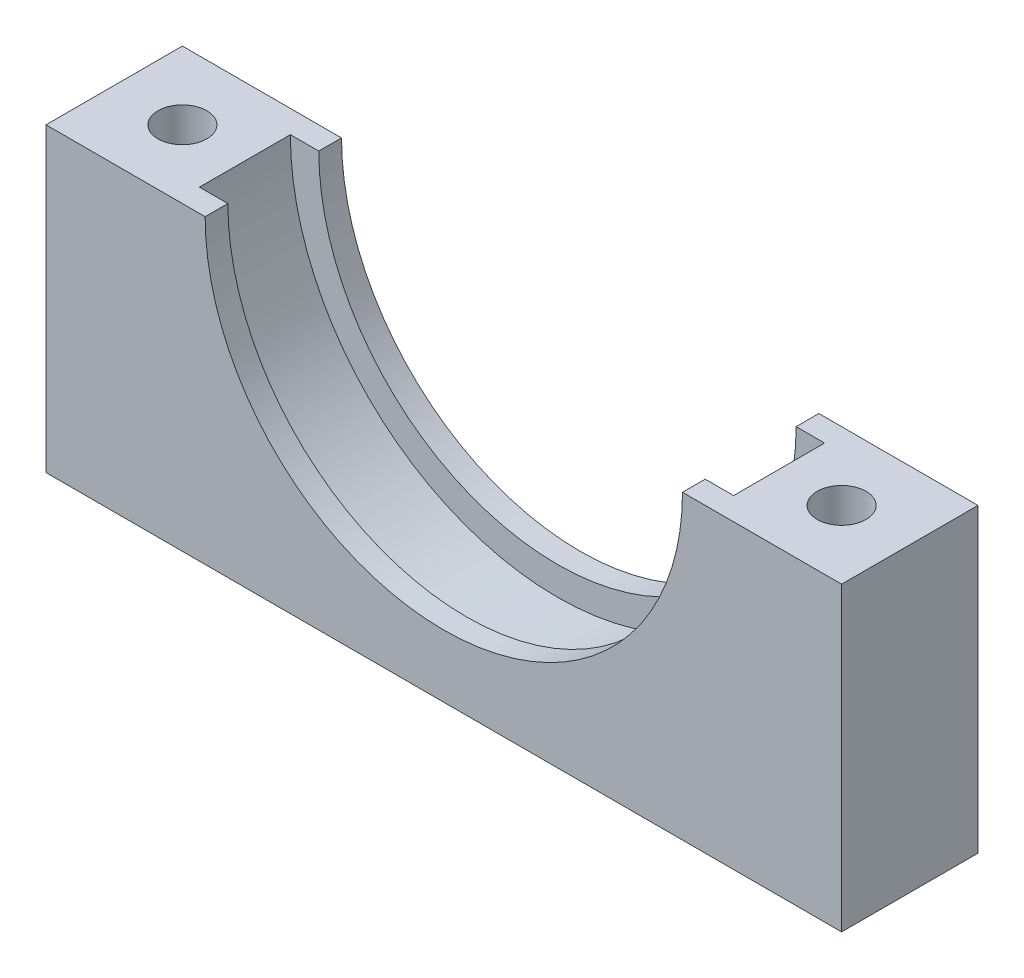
ISO-10303-21;
HEADER;
FILE_DESCRIPTION(('STEP AP214'),'2;1');
FILE_NAME('part.step','',(''),(''),'','','');
FILE_SCHEMA(('AUTOMOTIVE_DESIGN { 1 0 10303 214 1 1 1 1 }'));
ENDSEC;
DATA;
#1=APPLICATION_CONTEXT('core data for automotive mechanical design processes');
#2=APPLICATION_PROTOCOL_DEFINITION('international standard','automotive_design',2000,#1);
#3=PRODUCT_CONTEXT('',#1,'mechanical');
#4=PRODUCT('Part','Part','',(#3));
#5=PRODUCT_RELATED_PRODUCT_CATEGORY('part','',(#4));
#6=PRODUCT_DEFINITION_FORMATION('','',#4);
#7=PRODUCT_DEFINITION_CONTEXT('part definition',#1,'design');
#8=PRODUCT_DEFINITION('design','',#6,#7);
#9=PRODUCT_DEFINITION_SHAPE('','',#8);
#10=(LENGTH_UNIT() NAMED_UNIT(*) SI_UNIT(.MILLI.,.METRE.));
#11=(NAMED_UNIT(*) PLANE_ANGLE_UNIT() SI_UNIT($,.RADIAN.));
#12=(NAMED_UNIT(*) SI_UNIT($,.STERADIAN.) SOLID_ANGLE_UNIT());
#13=UNCERTAINTY_MEASURE_WITH_UNIT(LENGTH_MEASURE(1.E-05),#10,'distance_accuracy_value','');
#14=(GEOMETRIC_REPRESENTATION_CONTEXT(3) GLOBAL_UNCERTAINTY_ASSIGNED_CONTEXT((#13)) GLOBAL_UNIT_ASSIGNED_CONTEXT((#10,
#11,#12)) REPRESENTATION_CONTEXT('',''));
#15=CARTESIAN_POINT('',(0.,0.,0.));
#16=DIRECTION('',(0.,0.,1.));
#17=DIRECTION('',(1.,0.,0.));
#18=AXIS2_PLACEMENT_3D('',#15,#16,#17);
#19=CARTESIAN_POINT('',(53.,-25.,-86.8481796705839));
#20=DIRECTION('',(0.,1.,0.));
#21=DIRECTION('',(0.,0.,1.));
#22=AXIS2_PLACEMENT_3D('',#19,#20,#21);
#23=PLANE('',#22);
#24=CARTESIAN_POINT('',(45.,-25.,-6.));
#25=DIRECTION('',(0.,1.,0.));
#26=DIRECTION('',(0.,0.,1.));
#27=AXIS2_PLACEMENT_3D('',#24,#25,#26);
#28=CIRCLE('',#27,2.15);
#29=CARTESIAN_POINT('',(45.,-25.,-3.85));
#30=VERTEX_POINT('',#29);
#31=EDGE_CURVE('E159',#30,#30,#28,.T.);
#32=ORIENTED_EDGE('',*,*,#31,.F.);
#33=EDGE_LOOP('',(#32));
#34=FACE_BOUND('',#33,.T.);
#35=DIRECTION('',(0.,0.,-1.));
#36=VECTOR('',#35,1.);
#37=CARTESIAN_POINT('',(50.5,-25.,-2.));
#38=LINE('',#37,#36);
#39=CARTESIAN_POINT('',(50.5,-25.,-2.));
#40=VERTEX_POINT('',#39);
#41=CARTESIAN_POINT('',(50.5,-25.,-10.));
#42=VERTEX_POINT('',#41);
#43=EDGE_CURVE('E193',#40,#42,#38,.T.);
#44=ORIENTED_EDGE('',*,*,#43,.T.);
#45=DIRECTION('',(1.,0.,0.));
#46=VECTOR('',#45,1.);
#47=CARTESIAN_POINT('',(50.5,-25.,-10.));
#48=LINE('',#47,#46);
#49=CARTESIAN_POINT('',(53.,-25.,-10.));
#50=VERTEX_POINT('',#49);
#51=EDGE_CURVE('E166',#42,#50,#48,.T.);
#52=ORIENTED_EDGE('',*,*,#51,.T.);
#53=DIRECTION('',(0.,0.,1.));
#54=VECTOR('',#53,1.);
#55=CARTESIAN_POINT('',(53.,-25.,-86.8481796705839));
#56=LINE('',#55,#54);
#57=CARTESIAN_POINT('',(53.,-25.,-12.));
#58=VERTEX_POINT('',#57);
#59=EDGE_CURVE('E156',#58,#50,#56,.T.);
#60=ORIENTED_EDGE('',*,*,#59,.F.);
#61=DIRECTION('',(-1.,0.,0.));
#62=VECTOR('',#61,1.);
#63=CARTESIAN_POINT('',(53.,-25.,-12.));
#64=LINE('',#63,#62);
#65=CARTESIAN_POINT('',(39.,-25.,-12.));
#66=VERTEX_POINT('',#65);
#67=EDGE_CURVE('E86',#58,#66,#64,.T.);
#68=ORIENTED_EDGE('',*,*,#67,.T.);
#69=DIRECTION('',(0.,0.,1.));
#70=VECTOR('',#69,1.);
#71=CARTESIAN_POINT('',(39.,-25.,-86.8481796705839));
#72=LINE('',#71,#70);
#73=CARTESIAN_POINT('',(39.,-25.,0.));
#74=VERTEX_POINT('',#73);
#75=EDGE_CURVE('E136',#66,#74,#72,.T.);
#76=ORIENTED_EDGE('',*,*,#75,.T.);
#77=DIRECTION('',(-1.,0.,0.));
#78=VECTOR('',#77,1.);
#79=CARTESIAN_POINT('',(53.,-25.,0.));
#80=LINE('',#79,#78);
#81=CARTESIAN_POINT('',(53.,-25.,0.));
#82=VERTEX_POINT('',#81);
#83=EDGE_CURVE('E127',#82,#74,#80,.T.);
#84=ORIENTED_EDGE('',*,*,#83,.F.);
#85=CARTESIAN_POINT('',(53.,-25.,-2.));
#86=VERTEX_POINT('',#85);
#87=EDGE_CURVE('E59',#86,#82,#56,.T.);
#88=ORIENTED_EDGE('',*,*,#87,.F.);
#89=DIRECTION('',(1.,0.,0.));
#90=VECTOR('',#89,1.);
#91=CARTESIAN_POINT('',(50.5,-25.,-2.));
#92=LINE('',#91,#90);
#93=EDGE_CURVE('E51',#40,#86,#92,.T.);
#94=ORIENTED_EDGE('',*,*,#93,.F.);
#95=EDGE_LOOP('',(#44,#52,#60,#68,#76,#84,#88,#94));
#96=FACE_BOUND('',#95,.T.);
#97=ADVANCED_FACE('F34',(#34,#96),#23,.T.);
#98=CARTESIAN_POINT('',(109.,-25.,-86.8481796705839));
#99=DIRECTION('',(0.,1.,0.));
#100=DIRECTION('',(0.,0.,1.));
#101=AXIS2_PLACEMENT_3D('',#98,#99,#100);
#102=PLANE('',#101);
#103=CARTESIAN_POINT('',(103.,-25.,-6.));
#104=DIRECTION('',(0.,1.,0.));
#105=DIRECTION('',(0.,0.,1.));
#106=AXIS2_PLACEMENT_3D('',#103,#104,#105);
#107=CIRCLE('',#106,2.15);
#108=CARTESIAN_POINT('',(103.,-25.,-3.85));
#109=VERTEX_POINT('',#108);
#110=EDGE_CURVE('E38',#109,#109,#107,.T.);
#111=ORIENTED_EDGE('',*,*,#110,.F.);
#112=EDGE_LOOP('',(#111));
#113=FACE_BOUND('',#112,.T.);
#114=DIRECTION('',(0.,0.,1.));
#115=VECTOR('',#114,1.);
#116=CARTESIAN_POINT('',(95.,-25.,-86.8481796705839));
#117=LINE('',#116,#115);
#118=CARTESIAN_POINT('',(95.,-25.,-12.));
#119=VERTEX_POINT('',#118);
#120=CARTESIAN_POINT('',(95.,-25.,-10.));
#121=VERTEX_POINT('',#120);
#122=EDGE_CURVE('E140',#119,#121,#117,.T.);
#123=ORIENTED_EDGE('',*,*,#122,.T.);
#124=CARTESIAN_POINT('',(97.5,-25.,-10.));
#125=VERTEX_POINT('',#124);
#126=EDGE_CURVE('E161',#121,#125,#48,.T.);
#127=ORIENTED_EDGE('',*,*,#126,.T.);
#128=DIRECTION('',(0.,0.,-1.));
#129=VECTOR('',#128,1.);
#130=CARTESIAN_POINT('',(97.5,-25.,-2.));
#131=LINE('',#130,#129);
#132=CARTESIAN_POINT('',(97.5,-25.,-2.));
#133=VERTEX_POINT('',#132);
#134=EDGE_CURVE('E178',#133,#125,#131,.T.);
#135=ORIENTED_EDGE('',*,*,#134,.F.);
#136=CARTESIAN_POINT('',(95.,-25.,-2.));
#137=VERTEX_POINT('',#136);
#138=EDGE_CURVE('E185',#137,#133,#92,.T.);
#139=ORIENTED_EDGE('',*,*,#138,.F.);
#140=CARTESIAN_POINT('',(95.,-25.,0.));
#141=VERTEX_POINT('',#140);
#142=EDGE_CURVE('E144',#137,#141,#117,.T.);
#143=ORIENTED_EDGE('',*,*,#142,.T.);
#144=DIRECTION('',(-1.,0.,0.));
#145=VECTOR('',#144,1.);
#146=CARTESIAN_POINT('',(109.,-25.,0.));
#147=LINE('',#146,#145);
#148=CARTESIAN_POINT('',(109.,-25.,0.));
#149=VERTEX_POINT('',#148);
#150=EDGE_CURVE('E137',#149,#141,#147,.T.);
#151=ORIENTED_EDGE('',*,*,#150,.F.);
#152=DIRECTION('',(0.,0.,1.));
#153=VECTOR('',#152,1.);
#154=CARTESIAN_POINT('',(109.,-25.,-86.8481796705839));
#155=LINE('',#154,#153);
#156=CARTESIAN_POINT('',(109.,-25.,-12.));
#157=VERTEX_POINT('',#156);
#158=EDGE_CURVE('E145',#157,#149,#155,.T.);
#159=ORIENTED_EDGE('',*,*,#158,.F.);
#160=DIRECTION('',(-1.,0.,0.));
#161=VECTOR('',#160,1.);
#162=CARTESIAN_POINT('',(109.,-25.,-12.));
#163=LINE('',#162,#161);
#164=EDGE_CURVE('E141',#157,#119,#163,.T.);
#165=ORIENTED_EDGE('',*,*,#164,.T.);
#166=EDGE_LOOP('',(#123,#127,#135,#139,#143,#151,#159,#165));
#167=FACE_BOUND('',#166,.T.);
#168=ADVANCED_FACE('F201',(#113,#167),#102,.T.);
#169=CARTESIAN_POINT('',(74.,-25.,-86.8481796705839));
#170=DIRECTION('',(0.,0.,1.));
#171=DIRECTION('',(1.,0.,0.));
#172=AXIS2_PLACEMENT_3D('',#169,#170,#171);
#173=CYLINDRICAL_SURFACE('',#172,21.);
#174=ORIENTED_EDGE('',*,*,#59,.T.);
#175=CARTESIAN_POINT('',(74.,-25.,-9.99999999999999));
#176=DIRECTION('',(0.,0.,1.));
#177=DIRECTION('',(1.,0.,0.));
#178=AXIS2_PLACEMENT_3D('',#175,#176,#177);
#179=CIRCLE('',#178,21.);
#180=EDGE_CURVE('E12',#50,#121,#179,.T.);
#181=ORIENTED_EDGE('',*,*,#180,.T.);
#182=ORIENTED_EDGE('',*,*,#122,.F.);
#183=CARTESIAN_POINT('',(74.,-25.,-12.));
#184=DIRECTION('',(0.,0.,-1.));
#185=DIRECTION('',(-1.,0.,0.));
#186=AXIS2_PLACEMENT_3D('',#183,#184,#185);
#187=CIRCLE('',#186,21.);
#188=EDGE_CURVE('E138',#119,#58,#187,.T.);
#189=ORIENTED_EDGE('',*,*,#188,.T.);
#190=EDGE_LOOP('',(#174,#181,#182,#189));
#191=FACE_BOUND('',#190,.T.);
#192=ADVANCED_FACE('F210',(#191),#173,.F.);
#193=CARTESIAN_POINT('',(144.,19.,-12.));
#194=DIRECTION('',(0.,0.,-1.));
#195=DIRECTION('',(-1.,0.,0.));
#196=AXIS2_PLACEMENT_3D('',#193,#194,#195);
#197=PLANE('',#196);
#198=ORIENTED_EDGE('',*,*,#188,.F.);
#199=ORIENTED_EDGE('',*,*,#164,.F.);
#200=DIRECTION('',(0.,1.,0.));
#201=VECTOR('',#200,1.);
#202=CARTESIAN_POINT('',(109.,-51.5,-12.));
#203=LINE('',#202,#201);
#204=CARTESIAN_POINT('',(109.,-51.5,-12.));
#205=VERTEX_POINT('',#204);
#206=EDGE_CURVE('E146',#205,#157,#203,.T.);
#207=ORIENTED_EDGE('',*,*,#206,.F.);
#208=DIRECTION('',(1.,0.,0.));
#209=VECTOR('',#208,1.);
#210=CARTESIAN_POINT('',(39.,-51.5,-12.));
#211=LINE('',#210,#209);
#212=CARTESIAN_POINT('',(39.,-51.5,-12.));
#213=VERTEX_POINT('',#212);
#214=EDGE_CURVE('E113',#213,#205,#211,.T.);
#215=ORIENTED_EDGE('',*,*,#214,.F.);
#216=DIRECTION('',(0.,-1.,0.));
#217=VECTOR('',#216,1.);
#218=CARTESIAN_POINT('',(39.,-25.,-12.));
#219=LINE('',#218,#217);
#220=EDGE_CURVE('E92',#66,#213,#219,.T.);
#221=ORIENTED_EDGE('',*,*,#220,.F.);
#222=ORIENTED_EDGE('',*,*,#67,.F.);
#223=EDGE_LOOP('',(#198,#199,#207,#215,#221,#222));
#224=FACE_BOUND('',#223,.T.);
#225=ADVANCED_FACE('F36',(#224),#197,.T.);
#226=CARTESIAN_POINT('',(74.,-25.,0.));
#227=DIRECTION('',(0.,0.,-1.));
#228=DIRECTION('',(-1.,0.,0.));
#229=AXIS2_PLACEMENT_3D('',#226,#227,#228);
#230=PLANE('',#229);
#231=CARTESIAN_POINT('',(74.,-25.,0.));
#232=DIRECTION('',(0.,0.,-1.));
#233=DIRECTION('',(-1.,0.,0.));
#234=AXIS2_PLACEMENT_3D('',#231,#232,#233);
#235=CIRCLE('',#234,21.);
#236=EDGE_CURVE('E129',#141,#82,#235,.T.);
#237=ORIENTED_EDGE('',*,*,#236,.T.);
#238=ORIENTED_EDGE('',*,*,#83,.T.);
#239=DIRECTION('',(0.,-1.,0.));
#240=VECTOR('',#239,1.);
#241=CARTESIAN_POINT('',(39.,-25.,0.));
#242=LINE('',#241,#240);
#243=CARTESIAN_POINT('',(39.,-51.5,0.));
#244=VERTEX_POINT('',#243);
#245=EDGE_CURVE('E109',#74,#244,#242,.T.);
#246=ORIENTED_EDGE('',*,*,#245,.T.);
#247=DIRECTION('',(1.,0.,0.));
#248=VECTOR('',#247,1.);
#249=CARTESIAN_POINT('',(39.,-51.5,0.));
#250=LINE('',#249,#248);
#251=CARTESIAN_POINT('',(109.,-51.5,0.));
#252=VERTEX_POINT('',#251);
#253=EDGE_CURVE('E116',#244,#252,#250,.T.);
#254=ORIENTED_EDGE('',*,*,#253,.T.);
#255=DIRECTION('',(0.,1.,0.));
#256=VECTOR('',#255,1.);
#257=CARTESIAN_POINT('',(109.,-51.5,0.));
#258=LINE('',#257,#256);
#259=EDGE_CURVE('E123',#252,#149,#258,.T.);
#260=ORIENTED_EDGE('',*,*,#259,.T.);
#261=ORIENTED_EDGE('',*,*,#150,.T.);
#262=EDGE_LOOP('',(#237,#238,#246,#254,#260,#261));
#263=FACE_BOUND('',#262,.T.);
#264=ADVANCED_FACE('F126',(#263),#230,.F.);
#265=CARTESIAN_POINT('',(39.,-25.,-86.8481796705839));
#266=DIRECTION('',(-1.,0.,0.));
#267=DIRECTION('',(0.,0.,1.));
#268=AXIS2_PLACEMENT_3D('',#265,#266,#267);
#269=PLANE('',#268);
#270=ORIENTED_EDGE('',*,*,#75,.F.);
#271=ORIENTED_EDGE('',*,*,#220,.T.);
#272=DIRECTION('',(0.,0.,1.));
#273=VECTOR('',#272,1.);
#274=CARTESIAN_POINT('',(39.,-51.5,-86.8481796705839));
#275=LINE('',#274,#273);
#276=EDGE_CURVE('E105',#213,#244,#275,.T.);
#277=ORIENTED_EDGE('',*,*,#276,.T.);
#278=ORIENTED_EDGE('',*,*,#245,.F.);
#279=EDGE_LOOP('',(#270,#271,#277,#278));
#280=FACE_BOUND('',#279,.T.);
#281=ADVANCED_FACE('F107',(#280),#269,.T.);
#282=CARTESIAN_POINT('',(39.,-51.5,-86.8481796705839));
#283=DIRECTION('',(0.,-1.,0.));
#284=DIRECTION('',(0.,0.,-1.));
#285=AXIS2_PLACEMENT_3D('',#282,#283,#284);
#286=PLANE('',#285);
#287=CARTESIAN_POINT('',(103.,-51.5,-6.));
#288=DIRECTION('',(0.,-1.,0.));
#289=DIRECTION('',(0.,0.,-1.));
#290=AXIS2_PLACEMENT_3D('',#287,#288,#289);
#291=CIRCLE('',#290,4.);
#292=CARTESIAN_POINT('',(103.,-51.5,-10.));
#293=VERTEX_POINT('',#292);
#294=EDGE_CURVE('E245',#293,#293,#291,.T.);
#295=ORIENTED_EDGE('',*,*,#294,.F.);
#296=EDGE_LOOP('',(#295));
#297=FACE_BOUND('',#296,.T.);
#298=CARTESIAN_POINT('',(45.,-51.5,-6.));
#299=DIRECTION('',(0.,-1.,0.));
#300=DIRECTION('',(0.,0.,-1.));
#301=AXIS2_PLACEMENT_3D('',#298,#299,#300);
#302=CIRCLE('',#301,4.);
#303=CARTESIAN_POINT('',(45.,-51.5,-10.));
#304=VERTEX_POINT('',#303);
#305=EDGE_CURVE('E162',#304,#304,#302,.T.);
#306=ORIENTED_EDGE('',*,*,#305,.F.);
#307=EDGE_LOOP('',(#306));
#308=FACE_BOUND('',#307,.T.);
#309=ORIENTED_EDGE('',*,*,#276,.F.);
#310=ORIENTED_EDGE('',*,*,#214,.T.);
#311=DIRECTION('',(0.,0.,1.));
#312=VECTOR('',#311,1.);
#313=CARTESIAN_POINT('',(109.,-51.5,-86.8481796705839));
#314=LINE('',#313,#312);
#315=EDGE_CURVE('E119',#205,#252,#314,.T.);
#316=ORIENTED_EDGE('',*,*,#315,.T.);
#317=ORIENTED_EDGE('',*,*,#253,.F.);
#318=EDGE_LOOP('',(#309,#310,#316,#317));
#319=FACE_BOUND('',#318,.T.);
#320=ADVANCED_FACE('F117',(#297,#308,#319),#286,.T.);
#321=CARTESIAN_POINT('',(109.,-51.5,-86.8481796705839));
#322=DIRECTION('',(1.,0.,0.));
#323=DIRECTION('',(0.,1.,0.));
#324=AXIS2_PLACEMENT_3D('',#321,#322,#323);
#325=PLANE('',#324);
#326=ORIENTED_EDGE('',*,*,#315,.F.);
#327=ORIENTED_EDGE('',*,*,#206,.T.);
#328=ORIENTED_EDGE('',*,*,#158,.T.);
#329=ORIENTED_EDGE('',*,*,#259,.F.);
#330=EDGE_LOOP('',(#326,#327,#328,#329));
#331=FACE_BOUND('',#330,.T.);
#332=ADVANCED_FACE('F208',(#331),#325,.T.);
#333=CARTESIAN_POINT('',(74.,-25.,-2.));
#334=DIRECTION('',(0.,0.,1.));
#335=DIRECTION('',(1.,0.,0.));
#336=AXIS2_PLACEMENT_3D('',#333,#334,#335);
#337=CIRCLE('',#336,21.);
#338=EDGE_CURVE('E43',#86,#137,#337,.T.);
#339=ORIENTED_EDGE('',*,*,#338,.F.);
#340=ORIENTED_EDGE('',*,*,#87,.T.);
#341=ORIENTED_EDGE('',*,*,#236,.F.);
#342=ORIENTED_EDGE('',*,*,#142,.F.);
#343=EDGE_LOOP('',(#339,#340,#341,#342));
#344=FACE_BOUND('',#343,.T.);
#345=ADVANCED_FACE('F205',(#344),#173,.F.);
#346=CARTESIAN_POINT('',(74.,-88.1903194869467,-10.));
#347=DIRECTION('',(0.,0.,1.));
#348=DIRECTION('',(1.,0.,0.));
#349=AXIS2_PLACEMENT_3D('',#346,#347,#348);
#350=PLANE('',#349);
#351=ORIENTED_EDGE('',*,*,#51,.F.);
#352=CARTESIAN_POINT('',(74.,-25.,-10.));
#353=DIRECTION('',(0.,0.,-1.));
#354=DIRECTION('',(-1.,0.,0.));
#355=AXIS2_PLACEMENT_3D('',#352,#353,#354);
#356=CIRCLE('',#355,23.5);
#357=EDGE_CURVE('E181',#125,#42,#356,.T.);
#358=ORIENTED_EDGE('',*,*,#357,.F.);
#359=ORIENTED_EDGE('',*,*,#126,.F.);
#360=ORIENTED_EDGE('',*,*,#180,.F.);
#361=EDGE_LOOP('',(#351,#358,#359,#360));
#362=FACE_BOUND('',#361,.T.);
#363=ADVANCED_FACE('F207',(#362),#350,.T.);
#364=CARTESIAN_POINT('',(74.,-88.1903194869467,-2.));
#365=DIRECTION('',(0.,0.,1.));
#366=DIRECTION('',(1.,0.,0.));
#367=AXIS2_PLACEMENT_3D('',#364,#365,#366);
#368=PLANE('',#367);
#369=ORIENTED_EDGE('',*,*,#338,.T.);
#370=ORIENTED_EDGE('',*,*,#138,.T.);
#371=CARTESIAN_POINT('',(74.,-25.,-2.));
#372=DIRECTION('',(0.,0.,-1.));
#373=DIRECTION('',(-1.,0.,0.));
#374=AXIS2_PLACEMENT_3D('',#371,#372,#373);
#375=CIRCLE('',#374,23.5);
#376=EDGE_CURVE('E134',#133,#40,#375,.T.);
#377=ORIENTED_EDGE('',*,*,#376,.T.);
#378=ORIENTED_EDGE('',*,*,#93,.T.);
#379=EDGE_LOOP('',(#369,#370,#377,#378));
#380=FACE_BOUND('',#379,.T.);
#381=ADVANCED_FACE('F216',(#380),#368,.F.);
#382=CARTESIAN_POINT('',(74.,-25.,-2.));
#383=DIRECTION('',(0.,0.,-1.));
#384=DIRECTION('',(-1.,0.,0.));
#385=AXIS2_PLACEMENT_3D('',#382,#383,#384);
#386=CYLINDRICAL_SURFACE('',#385,23.5);
#387=ORIENTED_EDGE('',*,*,#357,.T.);
#388=ORIENTED_EDGE('',*,*,#43,.F.);
#389=ORIENTED_EDGE('',*,*,#376,.F.);
#390=ORIENTED_EDGE('',*,*,#134,.T.);
#391=EDGE_LOOP('',(#387,#388,#389,#390));
#392=FACE_BOUND('',#391,.T.);
#393=ADVANCED_FACE('F211',(#392),#386,.F.);
#394=CARTESIAN_POINT('',(45.,-51.5,-6.));
#395=DIRECTION('',(0.,-1.,0.));
#396=DIRECTION('',(0.,0.,-1.));
#397=AXIS2_PLACEMENT_3D('',#394,#395,#396);
#398=CYLINDRICAL_SURFACE('',#397,4.);
#399=CARTESIAN_POINT('',(45.,-47.5,-6.));
#400=DIRECTION('',(0.,-1.,0.));
#401=DIRECTION('',(0.,0.,-1.));
#402=AXIS2_PLACEMENT_3D('',#399,#400,#401);
#403=CIRCLE('',#402,4.);
#404=CARTESIAN_POINT('',(45.,-47.5,-10.));
#405=VERTEX_POINT('',#404);
#406=EDGE_CURVE('E169',#405,#405,#403,.T.);
#407=ORIENTED_EDGE('',*,*,#406,.F.);
#408=EDGE_LOOP('',(#407));
#409=FACE_BOUND('',#408,.T.);
#410=ORIENTED_EDGE('',*,*,#305,.T.);
#411=EDGE_LOOP('',(#410));
#412=FACE_BOUND('',#411,.T.);
#413=ADVANCED_FACE('F219',(#409,#412),#398,.F.);
#414=CARTESIAN_POINT('',(47.15,-47.5,-6.));
#415=DIRECTION('',(0.,1.,0.));
#416=DIRECTION('',(0.,0.,1.));
#417=AXIS2_PLACEMENT_3D('',#414,#415,#416);
#418=PLANE('',#417);
#419=CARTESIAN_POINT('',(45.,-47.5,-6.));
#420=DIRECTION('',(0.,-1.,0.));
#421=DIRECTION('',(0.,0.,-1.));
#422=AXIS2_PLACEMENT_3D('',#419,#420,#421);
#423=CIRCLE('',#422,2.15);
#424=CARTESIAN_POINT('',(45.,-47.5,-8.15));
#425=VERTEX_POINT('',#424);
#426=EDGE_CURVE('E174',#425,#425,#423,.T.);
#427=ORIENTED_EDGE('',*,*,#426,.F.);
#428=EDGE_LOOP('',(#427));
#429=FACE_BOUND('',#428,.T.);
#430=ORIENTED_EDGE('',*,*,#406,.T.);
#431=EDGE_LOOP('',(#430));
#432=FACE_BOUND('',#431,.T.);
#433=ADVANCED_FACE('F259',(#429,#432),#418,.F.);
#434=CARTESIAN_POINT('',(45.,-51.5,-6.));
#435=DIRECTION('',(0.,-1.,0.));
#436=DIRECTION('',(0.,0.,-1.));
#437=AXIS2_PLACEMENT_3D('',#434,#435,#436);
#438=CYLINDRICAL_SURFACE('',#437,2.15);
#439=ORIENTED_EDGE('',*,*,#31,.T.);
#440=EDGE_LOOP('',(#439));
#441=FACE_BOUND('',#440,.T.);
#442=ORIENTED_EDGE('',*,*,#426,.T.);
#443=EDGE_LOOP('',(#442));
#444=FACE_BOUND('',#443,.T.);
#445=ADVANCED_FACE('F257',(#441,#444),#438,.F.);
#446=CARTESIAN_POINT('',(103.,-51.5,-6.));
#447=DIRECTION('',(0.,-1.,0.));
#448=DIRECTION('',(0.,0.,-1.));
#449=AXIS2_PLACEMENT_3D('',#446,#447,#448);
#450=CYLINDRICAL_SURFACE('',#449,4.);
#451=CARTESIAN_POINT('',(103.,-47.5,-6.));
#452=DIRECTION('',(0.,-1.,0.));
#453=DIRECTION('',(0.,0.,-1.));
#454=AXIS2_PLACEMENT_3D('',#451,#452,#453);
#455=CIRCLE('',#454,4.);
#456=CARTESIAN_POINT('',(103.,-47.5,-10.));
#457=VERTEX_POINT('',#456);
#458=EDGE_CURVE('E247',#457,#457,#455,.T.);
#459=ORIENTED_EDGE('',*,*,#458,.F.);
#460=EDGE_LOOP('',(#459));
#461=FACE_BOUND('',#460,.T.);
#462=ORIENTED_EDGE('',*,*,#294,.T.);
#463=EDGE_LOOP('',(#462));
#464=FACE_BOUND('',#463,.T.);
#465=ADVANCED_FACE('F335',(#461,#464),#450,.F.);
#466=CARTESIAN_POINT('',(105.15,-47.5,-6.));
#467=DIRECTION('',(0.,1.,0.));
#468=DIRECTION('',(0.,0.,1.));
#469=AXIS2_PLACEMENT_3D('',#466,#467,#468);
#470=PLANE('',#469);
#471=CARTESIAN_POINT('',(103.,-47.5,-6.));
#472=DIRECTION('',(0.,-1.,0.));
#473=DIRECTION('',(0.,0.,-1.));
#474=AXIS2_PLACEMENT_3D('',#471,#472,#473);
#475=CIRCLE('',#474,2.15);
#476=CARTESIAN_POINT('',(103.,-47.5,-8.15));
#477=VERTEX_POINT('',#476);
#478=EDGE_CURVE('E251',#477,#477,#475,.T.);
#479=ORIENTED_EDGE('',*,*,#478,.F.);
#480=EDGE_LOOP('',(#479));
#481=FACE_BOUND('',#480,.T.);
#482=ORIENTED_EDGE('',*,*,#458,.T.);
#483=EDGE_LOOP('',(#482));
#484=FACE_BOUND('',#483,.T.);
#485=ADVANCED_FACE('F340',(#481,#484),#470,.F.);
#486=CARTESIAN_POINT('',(103.,-51.5,-6.));
#487=DIRECTION('',(0.,-1.,0.));
#488=DIRECTION('',(0.,0.,-1.));
#489=AXIS2_PLACEMENT_3D('',#486,#487,#488);
#490=CYLINDRICAL_SURFACE('',#489,2.15);
#491=ORIENTED_EDGE('',*,*,#110,.T.);
#492=EDGE_LOOP('',(#491));
#493=FACE_BOUND('',#492,.T.);
#494=ORIENTED_EDGE('',*,*,#478,.T.);
#495=EDGE_LOOP('',(#494));
#496=FACE_BOUND('',#495,.T.);
#497=ADVANCED_FACE('F350',(#493,#496),#490,.F.);
#498=CLOSED_SHELL('',(#97,#168,#192,#225,#264,#281,#320,#332,#345,#363,#381,#393,#413,#433,#445,
#465,#485,#497));
#499=MANIFOLD_SOLID_BREP('B2',#498);
#500=ADVANCED_BREP_SHAPE_REPRESENTATION('',(#18,#499),#14);
#501=SHAPE_DEFINITION_REPRESENTATION(#9,#500);
ENDSEC;
END-ISO-10303-21;
